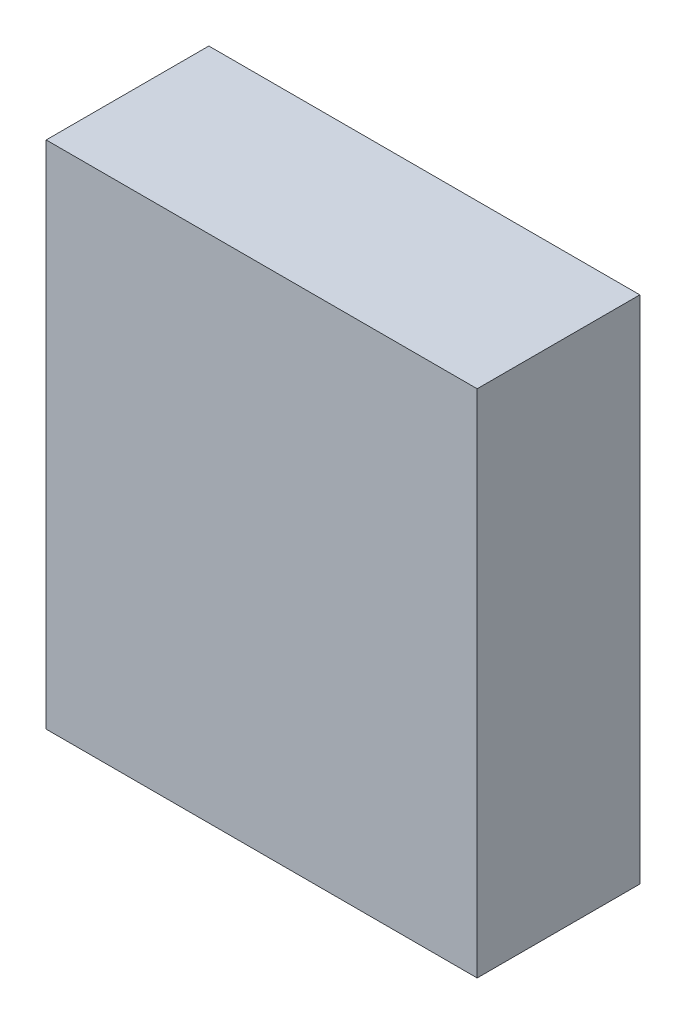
ISO-10303-21;
HEADER;
FILE_DESCRIPTION(('STEP AP214'),'2;1');
FILE_NAME('part.step','',(''),(''),'','','');
FILE_SCHEMA(('AUTOMOTIVE_DESIGN { 1 0 10303 214 1 1 1 1 }'));
ENDSEC;
DATA;
#1=APPLICATION_CONTEXT('core data for automotive mechanical design processes');
#2=APPLICATION_PROTOCOL_DEFINITION('international standard','automotive_design',2000,#1);
#3=PRODUCT_CONTEXT('',#1,'mechanical');
#4=PRODUCT('Part','Part','',(#3));
#5=PRODUCT_RELATED_PRODUCT_CATEGORY('part','',(#4));
#6=PRODUCT_DEFINITION_FORMATION('','',#4);
#7=PRODUCT_DEFINITION_CONTEXT('part definition',#1,'design');
#8=PRODUCT_DEFINITION('design','',#6,#7);
#9=PRODUCT_DEFINITION_SHAPE('','',#8);
#10=(LENGTH_UNIT() NAMED_UNIT(*) SI_UNIT(.MILLI.,.METRE.));
#11=(NAMED_UNIT(*) PLANE_ANGLE_UNIT() SI_UNIT($,.RADIAN.));
#12=(NAMED_UNIT(*) SI_UNIT($,.STERADIAN.) SOLID_ANGLE_UNIT());
#13=UNCERTAINTY_MEASURE_WITH_UNIT(LENGTH_MEASURE(1.E-05),#10,'distance_accuracy_value','');
#14=(GEOMETRIC_REPRESENTATION_CONTEXT(3) GLOBAL_UNCERTAINTY_ASSIGNED_CONTEXT((#13)) GLOBAL_UNIT_ASSIGNED_CONTEXT((#10,
#11,#12)) REPRESENTATION_CONTEXT('',''));
#15=CARTESIAN_POINT('',(0.,0.,0.));
#16=DIRECTION('',(0.,0.,1.));
#17=DIRECTION('',(1.,0.,0.));
#18=AXIS2_PLACEMENT_3D('',#15,#16,#17);
#19=CARTESIAN_POINT('',(0.,0.,6.1));
#20=DIRECTION('',(0.,0.,1.));
#21=DIRECTION('',(1.,0.,0.));
#22=AXIS2_PLACEMENT_3D('',#19,#20,#21);
#23=PLANE('',#22);
#24=DIRECTION('',(0.,1.,0.));
#25=VECTOR('',#24,1.);
#26=CARTESIAN_POINT('',(-8.081,9.846,6.1));
#27=LINE('',#26,#25);
#28=CARTESIAN_POINT('',(-8.081,-9.29,6.1));
#29=VERTEX_POINT('',#28);
#30=CARTESIAN_POINT('',(-8.081,9.846,6.1));
#31=VERTEX_POINT('',#30);
#32=EDGE_CURVE('E67',#29,#31,#27,.T.);
#33=ORIENTED_EDGE('',*,*,#32,.F.);
#34=DIRECTION('',(1.,0.,0.));
#35=VECTOR('',#34,1.);
#36=CARTESIAN_POINT('',(-8.081,-9.29,6.1));
#37=LINE('',#36,#35);
#38=CARTESIAN_POINT('',(8.081,-9.29,6.1));
#39=VERTEX_POINT('',#38);
#40=EDGE_CURVE('E19',#39,#29,#37,.F.);
#41=ORIENTED_EDGE('',*,*,#40,.F.);
#42=DIRECTION('',(0.,1.,0.));
#43=VECTOR('',#42,1.);
#44=CARTESIAN_POINT('',(8.081,-9.29,6.1));
#45=LINE('',#44,#43);
#46=CARTESIAN_POINT('',(8.081,9.846,6.1));
#47=VERTEX_POINT('',#46);
#48=EDGE_CURVE('E57',#47,#39,#45,.F.);
#49=ORIENTED_EDGE('',*,*,#48,.F.);
#50=DIRECTION('',(1.,0.,0.));
#51=VECTOR('',#50,1.);
#52=CARTESIAN_POINT('',(8.081,9.846,6.1));
#53=LINE('',#52,#51);
#54=EDGE_CURVE('E52',#31,#47,#53,.T.);
#55=ORIENTED_EDGE('',*,*,#54,.F.);
#56=EDGE_LOOP('',(#33,#41,#49,#55));
#57=FACE_BOUND('',#56,.T.);
#58=ADVANCED_FACE('F16',(#57),#23,.T.);
#59=CARTESIAN_POINT('',(-8.081,-9.29,0.));
#60=DIRECTION('',(0.,-1.,0.));
#61=DIRECTION('',(0.,0.,-1.));
#62=AXIS2_PLACEMENT_3D('',#59,#60,#61);
#63=PLANE('',#62);
#64=DIRECTION('',(0.,0.,1.));
#65=VECTOR('',#64,1.);
#66=CARTESIAN_POINT('',(-8.081,-9.29,0.));
#67=LINE('',#66,#65);
#68=CARTESIAN_POINT('',(-8.081,-9.29,0.));
#69=VERTEX_POINT('',#68);
#70=EDGE_CURVE('E78',#69,#29,#67,.T.);
#71=ORIENTED_EDGE('',*,*,#70,.F.);
#72=DIRECTION('',(1.,0.,0.));
#73=VECTOR('',#72,1.);
#74=CARTESIAN_POINT('',(0.,-9.29,0.));
#75=LINE('',#74,#73);
#76=CARTESIAN_POINT('',(8.081,-9.29,0.));
#77=VERTEX_POINT('',#76);
#78=EDGE_CURVE('E73',#69,#77,#75,.T.);
#79=ORIENTED_EDGE('',*,*,#78,.T.);
#80=DIRECTION('',(0.,0.,-1.));
#81=VECTOR('',#80,1.);
#82=CARTESIAN_POINT('',(8.081,-9.29,0.));
#83=LINE('',#82,#81);
#84=EDGE_CURVE('E62',#39,#77,#83,.T.);
#85=ORIENTED_EDGE('',*,*,#84,.F.);
#86=ORIENTED_EDGE('',*,*,#40,.T.);
#87=EDGE_LOOP('',(#71,#79,#85,#86));
#88=FACE_BOUND('',#87,.T.);
#89=ADVANCED_FACE('F72',(#88),#63,.T.);
#90=CARTESIAN_POINT('',(8.081,-9.29,0.));
#91=DIRECTION('',(1.,0.,0.));
#92=DIRECTION('',(0.,0.,-1.));
#93=AXIS2_PLACEMENT_3D('',#90,#91,#92);
#94=PLANE('',#93);
#95=ORIENTED_EDGE('',*,*,#84,.T.);
#96=DIRECTION('',(0.,1.,0.));
#97=VECTOR('',#96,1.);
#98=CARTESIAN_POINT('',(8.081,0.,0.));
#99=LINE('',#98,#97);
#100=CARTESIAN_POINT('',(8.081,9.846,0.));
#101=VERTEX_POINT('',#100);
#102=EDGE_CURVE('E83',#77,#101,#99,.T.);
#103=ORIENTED_EDGE('',*,*,#102,.T.);
#104=DIRECTION('',(0.,0.,1.));
#105=VECTOR('',#104,1.);
#106=CARTESIAN_POINT('',(8.081,9.846,0.));
#107=LINE('',#106,#105);
#108=EDGE_CURVE('E64',#47,#101,#107,.F.);
#109=ORIENTED_EDGE('',*,*,#108,.F.);
#110=ORIENTED_EDGE('',*,*,#48,.T.);
#111=EDGE_LOOP('',(#95,#103,#109,#110));
#112=FACE_BOUND('',#111,.T.);
#113=ADVANCED_FACE('F59',(#112),#94,.T.);
#114=CARTESIAN_POINT('',(8.081,9.846,0.));
#115=DIRECTION('',(0.,1.,0.));
#116=DIRECTION('',(0.,0.,1.));
#117=AXIS2_PLACEMENT_3D('',#114,#115,#116);
#118=PLANE('',#117);
#119=ORIENTED_EDGE('',*,*,#108,.T.);
#120=DIRECTION('',(1.,0.,0.));
#121=VECTOR('',#120,1.);
#122=CARTESIAN_POINT('',(0.,9.846,0.));
#123=LINE('',#122,#121);
#124=CARTESIAN_POINT('',(-8.081,9.846,0.));
#125=VERTEX_POINT('',#124);
#126=EDGE_CURVE('E25',#101,#125,#123,.F.);
#127=ORIENTED_EDGE('',*,*,#126,.T.);
#128=DIRECTION('',(0.,0.,1.));
#129=VECTOR('',#128,1.);
#130=CARTESIAN_POINT('',(-8.081,9.846,0.));
#131=LINE('',#130,#129);
#132=EDGE_CURVE('E33',#31,#125,#131,.F.);
#133=ORIENTED_EDGE('',*,*,#132,.F.);
#134=ORIENTED_EDGE('',*,*,#54,.T.);
#135=EDGE_LOOP('',(#119,#127,#133,#134));
#136=FACE_BOUND('',#135,.T.);
#137=ADVANCED_FACE('F87',(#136),#118,.T.);
#138=CARTESIAN_POINT('',(-8.081,9.846,0.));
#139=DIRECTION('',(-1.,0.,0.));
#140=DIRECTION('',(0.,0.,1.));
#141=AXIS2_PLACEMENT_3D('',#138,#139,#140);
#142=PLANE('',#141);
#143=ORIENTED_EDGE('',*,*,#132,.T.);
#144=DIRECTION('',(0.,1.,0.));
#145=VECTOR('',#144,1.);
#146=CARTESIAN_POINT('',(-8.081,0.,0.));
#147=LINE('',#146,#145);
#148=EDGE_CURVE('E11',#125,#69,#147,.F.);
#149=ORIENTED_EDGE('',*,*,#148,.T.);
#150=ORIENTED_EDGE('',*,*,#70,.T.);
#151=ORIENTED_EDGE('',*,*,#32,.T.);
#152=EDGE_LOOP('',(#143,#149,#150,#151));
#153=FACE_BOUND('',#152,.T.);
#154=ADVANCED_FACE('F90',(#153),#142,.T.);
#155=CARTESIAN_POINT('',(0.,0.,0.));
#156=DIRECTION('',(0.,0.,1.));
#157=DIRECTION('',(1.,0.,0.));
#158=AXIS2_PLACEMENT_3D('',#155,#156,#157);
#159=PLANE('',#158);
#160=ORIENTED_EDGE('',*,*,#126,.F.);
#161=ORIENTED_EDGE('',*,*,#102,.F.);
#162=ORIENTED_EDGE('',*,*,#78,.F.);
#163=ORIENTED_EDGE('',*,*,#148,.F.);
#164=EDGE_LOOP('',(#160,#161,#162,#163));
#165=FACE_BOUND('',#164,.T.);
#166=ADVANCED_FACE('F89',(#165),#159,.F.);
#167=CLOSED_SHELL('',(#58,#89,#113,#137,#154,#166));
#168=MANIFOLD_SOLID_BREP('B1',#167);
#169=ADVANCED_BREP_SHAPE_REPRESENTATION('',(#18,#168),#14);
#170=SHAPE_DEFINITION_REPRESENTATION(#9,#169);
ENDSEC;
END-ISO-10303-21;
